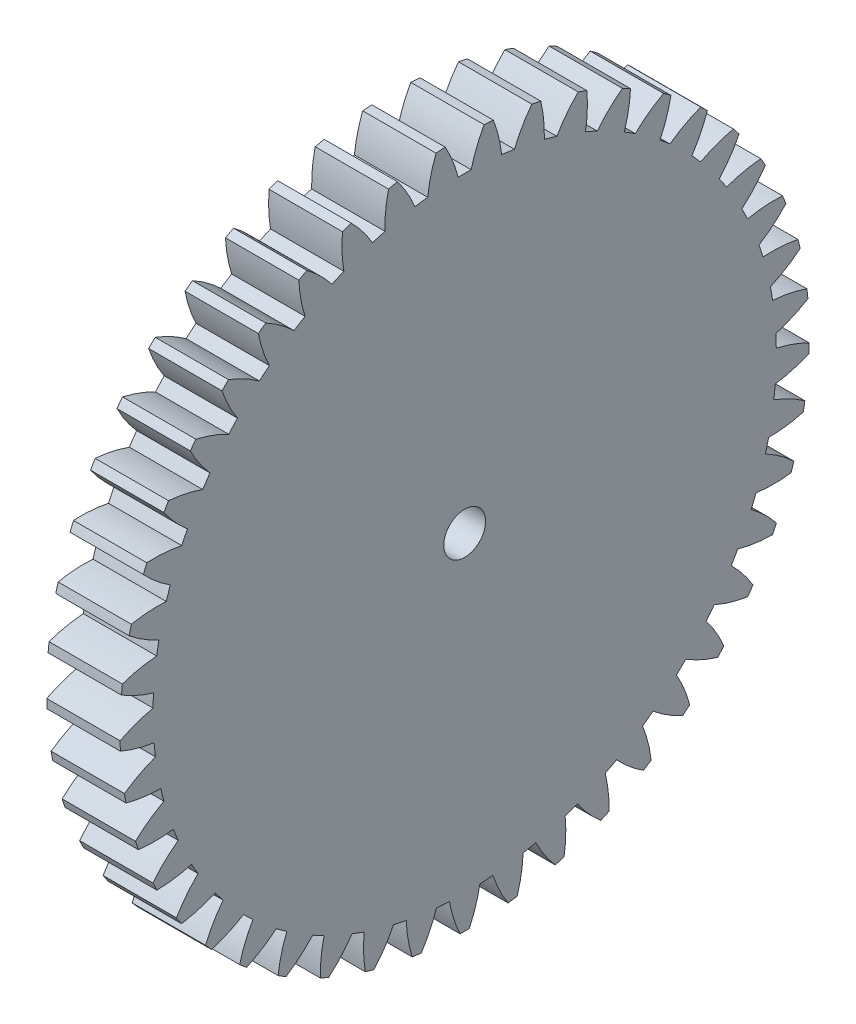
from build123d import *

# Parameters (mm, degrees)
BASPROSKE_W        = 5
BASPROSKE_H        = 23.5
TOOTHCUT_DEPTH     = 34.608034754
TEETHCUTS_COUNT    = 45
TEETHCUTS_ANGLE    = 352
BORSKE_R           = 1
BORE_DEPTH         = 50.0000508
SKETCH1_R          = 1.425
CUT_EXTRUDE1_DEPTH = 10


with BuildPart() as part:
    # BasProSke → Base-Revolve (revolve)
    with BuildSketch(Plane(origin=(0, 0, 0), x_dir=(1, 0, 0), z_dir=(0, 1, 0)), mode=Mode.PRIVATE) as base_revolve_sk:
        with Locations((2.5, 11.75)):
            Rectangle(BASPROSKE_W, BASPROSKE_H)
    revolve(base_revolve_sk.sketch.rotate(Axis((-10, 0, 0), (1, 0, 0)), 180), axis=Axis((-10, 0, 0), (1, 0, 0)))

    # TooCutSke → ToothCut (cut, through all)
    with BuildSketch(Plane(origin=(0, 0, 0), x_dir=(0, 0, -1), z_dir=(1, 0, 0))):
        with BuildLine():
            ThreePointArc((0.442593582, 21.244390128), (0, 21.249), (-0.442593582, 21.244390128))
            ThreePointArc((-0.442593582, 21.244390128), (-0.816027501, 22.396050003), (-1.340654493, 23.487168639))
            ThreePointArc((-1.340654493, 23.487168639), (0, 23.5254), (1.340654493, 23.487168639))
            ThreePointArc((1.340654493, 23.487168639), (0.816027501, 22.396050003), (0.442593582, 21.244390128))
        make_face()
    toothcut = extrude(amount=TOOTHCUT_DEPTH, mode=Mode.SUBTRACT)

    # TeethCuts: ToothCut ×45 about axis
    teethcuts_axis = Axis((-10, 0, 0), (1, 0, 0))
    for i in range(1, TEETHCUTS_COUNT):
        add(toothcut.rotate(teethcuts_axis, i * TEETHCUTS_ANGLE / (TEETHCUTS_COUNT - 1)), mode=Mode.SUBTRACT)

    # BorSke → Bore (cut, symmetric)
    with BuildSketch(Plane(origin=(0, 0, 0), x_dir=(0, 0, -1), z_dir=(1, 0, 0))):
        with Locations(Location((0, 0, 0), (0, 0, 180))):
            Circle(BORSKE_R)
    extrude(amount=BORE_DEPTH, both=True, mode=Mode.SUBTRACT)

    # Sketch1 → Cut-Extrude1 (cut)
    with BuildSketch(Plane(origin=(5, 0, 0), x_dir=(0, 0, -1), z_dir=(1, 0, 0))):
        Circle(SKETCH1_R)
    extrude(amount=-CUT_EXTRUDE1_DEPTH, mode=Mode.SUBTRACT)


solid = part.part
